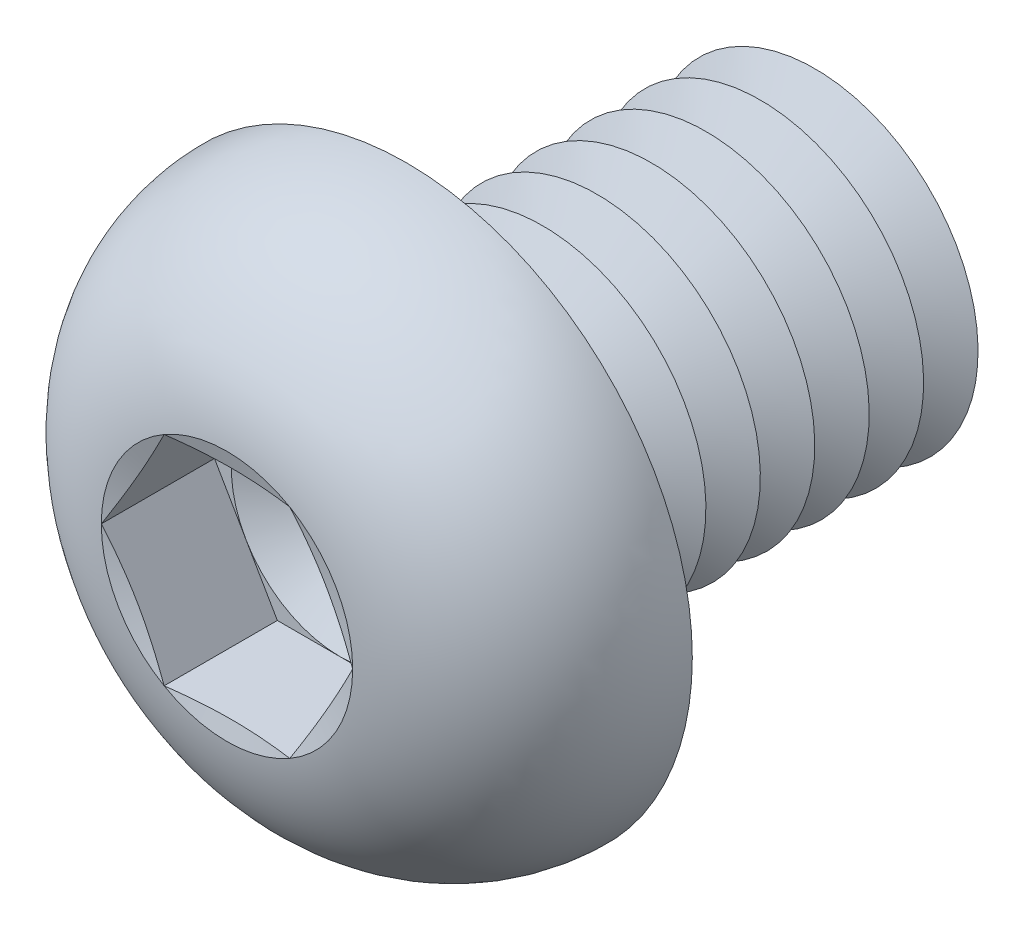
from build123d import *

# Parameters (mm, degrees)
FILLET1_R          = 0.5
LPATTERN1_COUNT    = 8
LPATTERN1_PITCH    = 1
CUT_EXTRUDE1_DEPTH = 2.08


with BuildPart() as part:
    # Sketch1 → Revolve1 (revolve)
    with BuildSketch(Plane(origin=(0, 0, 0), x_dir=(0, 0, -1), z_dir=(1, 0, 0))):
        with BuildLine():
            Line((0, 3), (0, 5.25))
            ThreePointArc((0, 5.25), (-2.210041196, 4.408189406), (-3.3, 2.3094))
            Line((-3.3, 2.3094), (-2.990599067, 1.1547))
            Line((-2.990599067, 1.1547), (-3.3, 1.1547))
            Line((-3.3, 1.1547), (-3.3, 0))
            Line((-3.3, 0), (8, 0))
            Line((8, 0), (8, 3))
            Line((8, 3), (0, 3))
        make_face()
    revolve(axis=Axis((0, 0, -8), (0, 0, 1)))

    # Fillet1
    fillet1_edges = [part.edges().sort_by_distance(p)[0] for p in [
        (0, -3, 0),
    ]]
    fillet(fillet1_edges, radius=FILLET1_R)

    # Sketch2 → Cut-Revolve1 (revolve, cut)
    with BuildSketch(Plane(origin=(0, 0, 0), x_dir=(0, 0, -1), z_dir=(1, 0, 0))):
        Polygon((7.5, 3), (8.5, 3), (8, 2.133974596), align=None)
    cut_revolve1 = revolve(axis=Axis((0, 0, -8), (0, 0, -1)), mode=Mode.SUBTRACT)

    # LPattern1: Cut-Revolve1 ×8
    with Locations(*[(0, 0, i * LPATTERN1_PITCH) for i in range(1, LPATTERN1_COUNT)]):
        add(cut_revolve1, mode=Mode.SUBTRACT)

    # Sketch3 → Cut-Extrude1 (cut)
    with BuildSketch(Plane.XY.offset(3.3)):
        Polygon((1.1547, 1.999999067), (-1.1547, 1.999999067), (-2.3094, 0), (-1.1547, -1.999999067), (1.1547, -1.999999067), (2.3094, 0), align=None)
    extrude(amount=-CUT_EXTRUDE1_DEPTH, mode=Mode.SUBTRACT)

    # Cut-Extrude2 cone 1 section (on through the dimple's axis) → Cut-Extrude2 (revolve, cut)
    with BuildSketch(Plane(origin=(0, 0, 1.22), x_dir=(0, -1, 0), z_dir=(1, 0, 0))):
        Polygon((0, 0), (1.999999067, 0), (0, 1.1547), align=None)
    revolve(axis=Axis((0, 0, 1.22), (0, 0, -1)), mode=Mode.SUBTRACT)


solid = part.part
